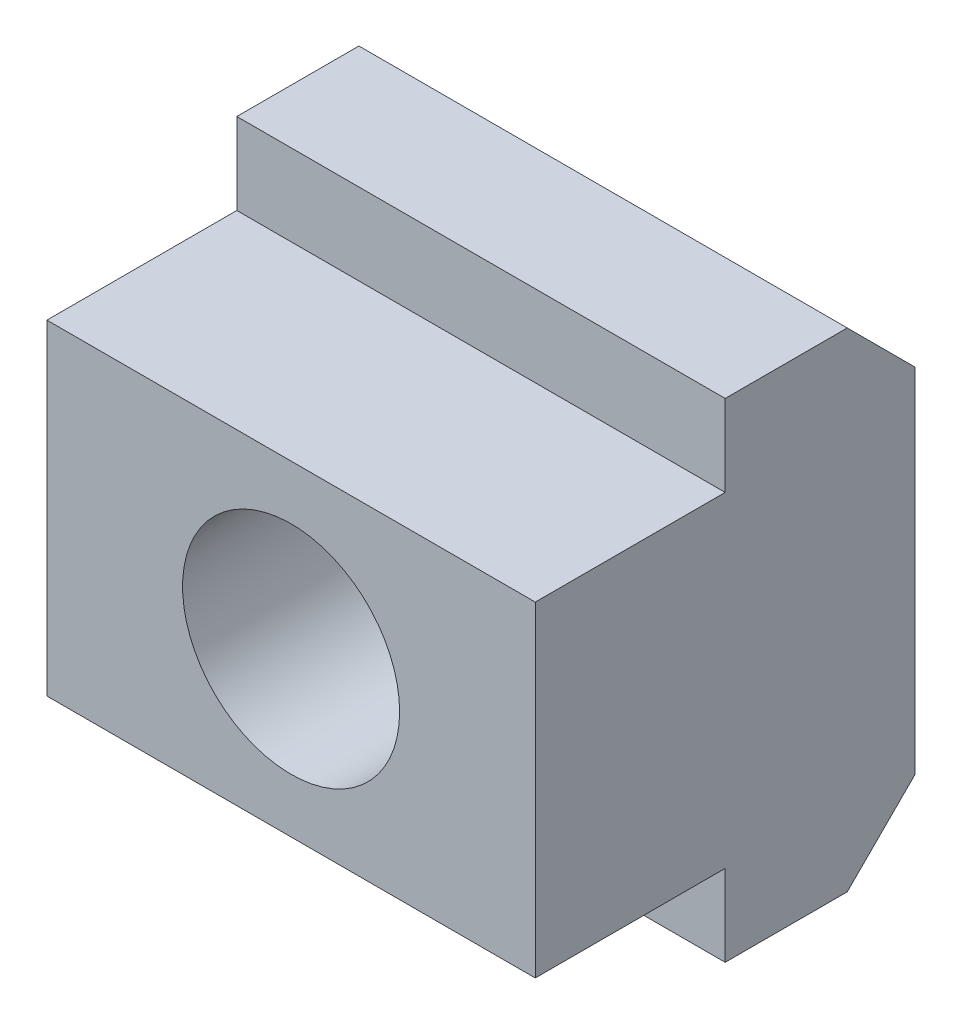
ISO-10303-21;
HEADER;
FILE_DESCRIPTION(('STEP AP214'),'2;1');
FILE_NAME('part.step','',(''),(''),'','','');
FILE_SCHEMA(('AUTOMOTIVE_DESIGN { 1 0 10303 214 1 1 1 1 }'));
ENDSEC;
DATA;
#1=APPLICATION_CONTEXT('core data for automotive mechanical design processes');
#2=APPLICATION_PROTOCOL_DEFINITION('international standard','automotive_design',2000,#1);
#3=PRODUCT_CONTEXT('',#1,'mechanical');
#4=PRODUCT('Part','Part','',(#3));
#5=PRODUCT_RELATED_PRODUCT_CATEGORY('part','',(#4));
#6=PRODUCT_DEFINITION_FORMATION('','',#4);
#7=PRODUCT_DEFINITION_CONTEXT('part definition',#1,'design');
#8=PRODUCT_DEFINITION('design','',#6,#7);
#9=PRODUCT_DEFINITION_SHAPE('','',#8);
#10=(LENGTH_UNIT() NAMED_UNIT(*) SI_UNIT(.MILLI.,.METRE.));
#11=(NAMED_UNIT(*) PLANE_ANGLE_UNIT() SI_UNIT($,.RADIAN.));
#12=(NAMED_UNIT(*) SI_UNIT($,.STERADIAN.) SOLID_ANGLE_UNIT());
#13=UNCERTAINTY_MEASURE_WITH_UNIT(LENGTH_MEASURE(1.E-05),#10,'distance_accuracy_value','');
#14=(GEOMETRIC_REPRESENTATION_CONTEXT(3) GLOBAL_UNCERTAINTY_ASSIGNED_CONTEXT((#13)) GLOBAL_UNIT_ASSIGNED_CONTEXT((#10,
#11,#12)) REPRESENTATION_CONTEXT('',''));
#15=CARTESIAN_POINT('',(0.,0.,0.));
#16=DIRECTION('',(0.,0.,1.));
#17=DIRECTION('',(1.,0.,0.));
#18=AXIS2_PLACEMENT_3D('',#15,#16,#17);
#19=CARTESIAN_POINT('',(9.,6.,7.));
#20=DIRECTION('',(0.,0.,-1.));
#21=DIRECTION('',(0.,1.,0.));
#22=AXIS2_PLACEMENT_3D('',#19,#20,#21);
#23=PLANE('',#22);
#24=CARTESIAN_POINT('',(0.,0.,7.));
#25=DIRECTION('',(0.,0.,1.));
#26=DIRECTION('',(1.,0.,0.));
#27=AXIS2_PLACEMENT_3D('',#24,#25,#26);
#28=CIRCLE('',#27,4.);
#29=CARTESIAN_POINT('',(4.,0.,7.));
#30=VERTEX_POINT('',#29);
#31=EDGE_CURVE('E172',#30,#30,#28,.T.);
#32=ORIENTED_EDGE('',*,*,#31,.F.);
#33=EDGE_LOOP('',(#32));
#34=FACE_BOUND('',#33,.T.);
#35=DIRECTION('',(-1.,0.,0.));
#36=VECTOR('',#35,1.);
#37=CARTESIAN_POINT('',(9.,-6.,7.));
#38=LINE('',#37,#36);
#39=CARTESIAN_POINT('',(9.,-6.,7.));
#40=VERTEX_POINT('',#39);
#41=CARTESIAN_POINT('',(-9.,-6.,7.));
#42=VERTEX_POINT('',#41);
#43=EDGE_CURVE('E151',#40,#42,#38,.T.);
#44=ORIENTED_EDGE('',*,*,#43,.F.);
#45=DIRECTION('',(0.,-1.,0.));
#46=VECTOR('',#45,1.);
#47=CARTESIAN_POINT('',(9.,6.,7.));
#48=LINE('',#47,#46);
#49=CARTESIAN_POINT('',(9.,6.,7.));
#50=VERTEX_POINT('',#49);
#51=EDGE_CURVE('E130',#50,#40,#48,.T.);
#52=ORIENTED_EDGE('',*,*,#51,.F.);
#53=DIRECTION('',(-1.,0.,0.));
#54=VECTOR('',#53,1.);
#55=CARTESIAN_POINT('',(9.,6.,7.));
#56=LINE('',#55,#54);
#57=CARTESIAN_POINT('',(-9.,6.,7.));
#58=VERTEX_POINT('',#57);
#59=EDGE_CURVE('E153',#50,#58,#56,.T.);
#60=ORIENTED_EDGE('',*,*,#59,.T.);
#61=DIRECTION('',(0.,-1.,0.));
#62=VECTOR('',#61,1.);
#63=CARTESIAN_POINT('',(-9.,6.,7.));
#64=LINE('',#63,#62);
#65=EDGE_CURVE('E182',#58,#42,#64,.T.);
#66=ORIENTED_EDGE('',*,*,#65,.T.);
#67=EDGE_LOOP('',(#44,#52,#60,#66));
#68=FACE_BOUND('',#67,.T.);
#69=ADVANCED_FACE('F14',(#34,#68),#23,.F.);
#70=CARTESIAN_POINT('',(9.,6.5,-7.));
#71=DIRECTION('',(0.,-0.707106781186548,0.707106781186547));
#72=DIRECTION('',(0.,-0.707106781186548,-0.707106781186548));
#73=AXIS2_PLACEMENT_3D('',#70,#71,#72);
#74=PLANE('',#73);
#75=DIRECTION('',(-1.,0.,0.));
#76=VECTOR('',#75,1.);
#77=CARTESIAN_POINT('',(9.,9.,-4.5));
#78=LINE('',#77,#76);
#79=CARTESIAN_POINT('',(9.,9.,-4.5));
#80=VERTEX_POINT('',#79);
#81=CARTESIAN_POINT('',(-9.,9.,-4.5));
#82=VERTEX_POINT('',#81);
#83=EDGE_CURVE('E9',#80,#82,#78,.T.);
#84=ORIENTED_EDGE('',*,*,#83,.F.);
#85=DIRECTION('',(0.,0.707106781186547,0.707106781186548));
#86=VECTOR('',#85,1.);
#87=CARTESIAN_POINT('',(9.,6.5,-7.));
#88=LINE('',#87,#86);
#89=CARTESIAN_POINT('',(9.,6.5,-7.));
#90=VERTEX_POINT('',#89);
#91=EDGE_CURVE('E140',#90,#80,#88,.T.);
#92=ORIENTED_EDGE('',*,*,#91,.F.);
#93=DIRECTION('',(-1.,0.,0.));
#94=VECTOR('',#93,1.);
#95=CARTESIAN_POINT('',(9.,6.5,-7.));
#96=LINE('',#95,#94);
#97=CARTESIAN_POINT('',(-9.,6.5,-7.));
#98=VERTEX_POINT('',#97);
#99=EDGE_CURVE('E29',#90,#98,#96,.T.);
#100=ORIENTED_EDGE('',*,*,#99,.T.);
#101=DIRECTION('',(0.,0.707106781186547,0.707106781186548));
#102=VECTOR('',#101,1.);
#103=CARTESIAN_POINT('',(-9.,6.5,-7.));
#104=LINE('',#103,#102);
#105=EDGE_CURVE('E101',#98,#82,#104,.T.);
#106=ORIENTED_EDGE('',*,*,#105,.T.);
#107=EDGE_LOOP('',(#84,#92,#100,#106));
#108=FACE_BOUND('',#107,.T.);
#109=ADVANCED_FACE('F102',(#108),#74,.F.);
#110=CARTESIAN_POINT('',(9.,9.,-4.5));
#111=DIRECTION('',(0.,-1.,0.));
#112=DIRECTION('',(0.,0.,-1.));
#113=AXIS2_PLACEMENT_3D('',#110,#111,#112);
#114=PLANE('',#113);
#115=DIRECTION('',(-1.,0.,0.));
#116=VECTOR('',#115,1.);
#117=CARTESIAN_POINT('',(9.,9.,0.));
#118=LINE('',#117,#116);
#119=CARTESIAN_POINT('',(9.,9.,0.));
#120=VERTEX_POINT('',#119);
#121=CARTESIAN_POINT('',(-9.,9.,0.));
#122=VERTEX_POINT('',#121);
#123=EDGE_CURVE('E22',#120,#122,#118,.T.);
#124=ORIENTED_EDGE('',*,*,#123,.F.);
#125=DIRECTION('',(0.,0.,1.));
#126=VECTOR('',#125,1.);
#127=CARTESIAN_POINT('',(9.,9.,-4.5));
#128=LINE('',#127,#126);
#129=EDGE_CURVE('E97',#80,#120,#128,.T.);
#130=ORIENTED_EDGE('',*,*,#129,.F.);
#131=ORIENTED_EDGE('',*,*,#83,.T.);
#132=DIRECTION('',(0.,0.,1.));
#133=VECTOR('',#132,1.);
#134=CARTESIAN_POINT('',(-9.,9.,-4.5));
#135=LINE('',#134,#133);
#136=EDGE_CURVE('E94',#82,#122,#135,.T.);
#137=ORIENTED_EDGE('',*,*,#136,.T.);
#138=EDGE_LOOP('',(#124,#130,#131,#137));
#139=FACE_BOUND('',#138,.T.);
#140=ADVANCED_FACE('F16',(#139),#114,.F.);
#141=CARTESIAN_POINT('',(9.,9.,0.));
#142=DIRECTION('',(0.,0.,-1.));
#143=DIRECTION('',(-1.,0.,0.));
#144=AXIS2_PLACEMENT_3D('',#141,#142,#143);
#145=PLANE('',#144);
#146=DIRECTION('',(-1.,0.,0.));
#147=VECTOR('',#146,1.);
#148=CARTESIAN_POINT('',(9.,6.,0.));
#149=LINE('',#148,#147);
#150=CARTESIAN_POINT('',(9.,6.,0.));
#151=VERTEX_POINT('',#150);
#152=CARTESIAN_POINT('',(-9.,6.,0.));
#153=VERTEX_POINT('',#152);
#154=EDGE_CURVE('E155',#151,#153,#149,.T.);
#155=ORIENTED_EDGE('',*,*,#154,.F.);
#156=DIRECTION('',(0.,-1.,0.));
#157=VECTOR('',#156,1.);
#158=CARTESIAN_POINT('',(9.,9.,0.));
#159=LINE('',#158,#157);
#160=EDGE_CURVE('E136',#120,#151,#159,.T.);
#161=ORIENTED_EDGE('',*,*,#160,.F.);
#162=ORIENTED_EDGE('',*,*,#123,.T.);
#163=DIRECTION('',(0.,-1.,0.));
#164=VECTOR('',#163,1.);
#165=CARTESIAN_POINT('',(-9.,9.,0.));
#166=LINE('',#165,#164);
#167=EDGE_CURVE('E110',#122,#153,#166,.T.);
#168=ORIENTED_EDGE('',*,*,#167,.T.);
#169=EDGE_LOOP('',(#155,#161,#162,#168));
#170=FACE_BOUND('',#169,.T.);
#171=ADVANCED_FACE('F158',(#170),#145,.F.);
#172=CARTESIAN_POINT('',(9.,6.,0.));
#173=DIRECTION('',(0.,-1.,0.));
#174=DIRECTION('',(0.,0.,-1.));
#175=AXIS2_PLACEMENT_3D('',#172,#173,#174);
#176=PLANE('',#175);
#177=ORIENTED_EDGE('',*,*,#59,.F.);
#178=DIRECTION('',(0.,0.,1.));
#179=VECTOR('',#178,1.);
#180=CARTESIAN_POINT('',(9.,6.,0.));
#181=LINE('',#180,#179);
#182=EDGE_CURVE('E133',#151,#50,#181,.T.);
#183=ORIENTED_EDGE('',*,*,#182,.F.);
#184=ORIENTED_EDGE('',*,*,#154,.T.);
#185=DIRECTION('',(0.,0.,1.));
#186=VECTOR('',#185,1.);
#187=CARTESIAN_POINT('',(-9.,6.,0.));
#188=LINE('',#187,#186);
#189=EDGE_CURVE('E112',#153,#58,#188,.T.);
#190=ORIENTED_EDGE('',*,*,#189,.T.);
#191=EDGE_LOOP('',(#177,#183,#184,#190));
#192=FACE_BOUND('',#191,.T.);
#193=ADVANCED_FACE('F187',(#192),#176,.F.);
#194=CARTESIAN_POINT('',(9.,-6.,7.));
#195=DIRECTION('',(0.,1.,0.));
#196=DIRECTION('',(0.,0.,1.));
#197=AXIS2_PLACEMENT_3D('',#194,#195,#196);
#198=PLANE('',#197);
#199=DIRECTION('',(-1.,0.,0.));
#200=VECTOR('',#199,1.);
#201=CARTESIAN_POINT('',(9.,-6.,0.));
#202=LINE('',#201,#200);
#203=CARTESIAN_POINT('',(9.,-6.,0.));
#204=VERTEX_POINT('',#203);
#205=CARTESIAN_POINT('',(-9.,-6.,0.));
#206=VERTEX_POINT('',#205);
#207=EDGE_CURVE('E149',#204,#206,#202,.T.);
#208=ORIENTED_EDGE('',*,*,#207,.F.);
#209=DIRECTION('',(0.,0.,-1.));
#210=VECTOR('',#209,1.);
#211=CARTESIAN_POINT('',(9.,-6.,7.));
#212=LINE('',#211,#210);
#213=EDGE_CURVE('E127',#40,#204,#212,.T.);
#214=ORIENTED_EDGE('',*,*,#213,.F.);
#215=ORIENTED_EDGE('',*,*,#43,.T.);
#216=DIRECTION('',(0.,0.,-1.));
#217=VECTOR('',#216,1.);
#218=CARTESIAN_POINT('',(-9.,-6.,7.));
#219=LINE('',#218,#217);
#220=EDGE_CURVE('E179',#42,#206,#219,.T.);
#221=ORIENTED_EDGE('',*,*,#220,.T.);
#222=EDGE_LOOP('',(#208,#214,#215,#221));
#223=FACE_BOUND('',#222,.T.);
#224=ADVANCED_FACE('F195',(#223),#198,.F.);
#225=CARTESIAN_POINT('',(9.,-6.,0.));
#226=DIRECTION('',(0.,0.,-1.));
#227=DIRECTION('',(-1.,0.,0.));
#228=AXIS2_PLACEMENT_3D('',#225,#226,#227);
#229=PLANE('',#228);
#230=DIRECTION('',(-1.,0.,0.));
#231=VECTOR('',#230,1.);
#232=CARTESIAN_POINT('',(9.,-9.,0.));
#233=LINE('',#232,#231);
#234=CARTESIAN_POINT('',(9.,-9.,0.));
#235=VERTEX_POINT('',#234);
#236=CARTESIAN_POINT('',(-9.,-9.,0.));
#237=VERTEX_POINT('',#236);
#238=EDGE_CURVE('E147',#235,#237,#233,.T.);
#239=ORIENTED_EDGE('',*,*,#238,.F.);
#240=DIRECTION('',(0.,-1.,0.));
#241=VECTOR('',#240,1.);
#242=CARTESIAN_POINT('',(9.,-6.,0.));
#243=LINE('',#242,#241);
#244=EDGE_CURVE('E124',#204,#235,#243,.T.);
#245=ORIENTED_EDGE('',*,*,#244,.F.);
#246=ORIENTED_EDGE('',*,*,#207,.T.);
#247=DIRECTION('',(0.,-1.,0.));
#248=VECTOR('',#247,1.);
#249=CARTESIAN_POINT('',(-9.,-6.,0.));
#250=LINE('',#249,#248);
#251=EDGE_CURVE('E176',#206,#237,#250,.T.);
#252=ORIENTED_EDGE('',*,*,#251,.T.);
#253=EDGE_LOOP('',(#239,#245,#246,#252));
#254=FACE_BOUND('',#253,.T.);
#255=ADVANCED_FACE('F197',(#254),#229,.F.);
#256=CARTESIAN_POINT('',(9.,-9.,0.));
#257=DIRECTION('',(0.,1.,0.));
#258=DIRECTION('',(0.,0.,1.));
#259=AXIS2_PLACEMENT_3D('',#256,#257,#258);
#260=PLANE('',#259);
#261=DIRECTION('',(-1.,0.,0.));
#262=VECTOR('',#261,1.);
#263=CARTESIAN_POINT('',(9.,-9.,-4.5));
#264=LINE('',#263,#262);
#265=CARTESIAN_POINT('',(9.,-9.,-4.5));
#266=VERTEX_POINT('',#265);
#267=CARTESIAN_POINT('',(-9.,-9.,-4.5));
#268=VERTEX_POINT('',#267);
#269=EDGE_CURVE('E145',#266,#268,#264,.T.);
#270=ORIENTED_EDGE('',*,*,#269,.F.);
#271=DIRECTION('',(0.,0.,-1.));
#272=VECTOR('',#271,1.);
#273=CARTESIAN_POINT('',(9.,-9.,0.));
#274=LINE('',#273,#272);
#275=EDGE_CURVE('E121',#235,#266,#274,.T.);
#276=ORIENTED_EDGE('',*,*,#275,.F.);
#277=ORIENTED_EDGE('',*,*,#238,.T.);
#278=DIRECTION('',(0.,0.,-1.));
#279=VECTOR('',#278,1.);
#280=CARTESIAN_POINT('',(-9.,-9.,0.));
#281=LINE('',#280,#279);
#282=EDGE_CURVE('E168',#237,#268,#281,.T.);
#283=ORIENTED_EDGE('',*,*,#282,.T.);
#284=EDGE_LOOP('',(#270,#276,#277,#283));
#285=FACE_BOUND('',#284,.T.);
#286=ADVANCED_FACE('F200',(#285),#260,.F.);
#287=CARTESIAN_POINT('',(9.,-9.,-4.5));
#288=DIRECTION('',(0.,0.707106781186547,0.707106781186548));
#289=DIRECTION('',(0.,-0.707106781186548,0.707106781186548));
#290=AXIS2_PLACEMENT_3D('',#287,#288,#289);
#291=PLANE('',#290);
#292=DIRECTION('',(-1.,0.,0.));
#293=VECTOR('',#292,1.);
#294=CARTESIAN_POINT('',(9.,-6.5,-7.));
#295=LINE('',#294,#293);
#296=CARTESIAN_POINT('',(9.,-6.5,-7.));
#297=VERTEX_POINT('',#296);
#298=CARTESIAN_POINT('',(-9.,-6.5,-7.));
#299=VERTEX_POINT('',#298);
#300=EDGE_CURVE('E37',#297,#299,#295,.T.);
#301=ORIENTED_EDGE('',*,*,#300,.F.);
#302=DIRECTION('',(0.,0.707106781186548,-0.707106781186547));
#303=VECTOR('',#302,1.);
#304=CARTESIAN_POINT('',(9.,-9.,-4.5));
#305=LINE('',#304,#303);
#306=EDGE_CURVE('E119',#266,#297,#305,.T.);
#307=ORIENTED_EDGE('',*,*,#306,.F.);
#308=ORIENTED_EDGE('',*,*,#269,.T.);
#309=DIRECTION('',(0.,0.707106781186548,-0.707106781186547));
#310=VECTOR('',#309,1.);
#311=CARTESIAN_POINT('',(-9.,-9.,-4.5));
#312=LINE('',#311,#310);
#313=EDGE_CURVE('E164',#268,#299,#312,.T.);
#314=ORIENTED_EDGE('',*,*,#313,.T.);
#315=EDGE_LOOP('',(#301,#307,#308,#314));
#316=FACE_BOUND('',#315,.T.);
#317=ADVANCED_FACE('F165',(#316),#291,.F.);
#318=CARTESIAN_POINT('',(9.,-6.5,-7.));
#319=DIRECTION('',(0.,0.,1.));
#320=DIRECTION('',(1.,0.,0.));
#321=AXIS2_PLACEMENT_3D('',#318,#319,#320);
#322=PLANE('',#321);
#323=CARTESIAN_POINT('',(0.,0.,-7.));
#324=DIRECTION('',(0.,0.,1.));
#325=DIRECTION('',(1.,0.,0.));
#326=AXIS2_PLACEMENT_3D('',#323,#324,#325);
#327=CIRCLE('',#326,4.);
#328=CARTESIAN_POINT('',(4.,0.,-7.));
#329=VERTEX_POINT('',#328);
#330=EDGE_CURVE('E105',#329,#329,#327,.T.);
#331=ORIENTED_EDGE('',*,*,#330,.T.);
#332=EDGE_LOOP('',(#331));
#333=FACE_BOUND('',#332,.T.);
#334=DIRECTION('',(0.,1.,0.));
#335=VECTOR('',#334,1.);
#336=CARTESIAN_POINT('',(9.,-6.5,-7.));
#337=LINE('',#336,#335);
#338=EDGE_CURVE('E116',#297,#90,#337,.T.);
#339=ORIENTED_EDGE('',*,*,#338,.F.);
#340=ORIENTED_EDGE('',*,*,#300,.T.);
#341=DIRECTION('',(0.,1.,0.));
#342=VECTOR('',#341,1.);
#343=CARTESIAN_POINT('',(-9.,-6.5,-7.));
#344=LINE('',#343,#342);
#345=EDGE_CURVE('E142',#299,#98,#344,.T.);
#346=ORIENTED_EDGE('',*,*,#345,.T.);
#347=ORIENTED_EDGE('',*,*,#99,.F.);
#348=EDGE_LOOP('',(#339,#340,#346,#347));
#349=FACE_BOUND('',#348,.T.);
#350=ADVANCED_FACE('F162',(#333,#349),#322,.F.);
#351=CARTESIAN_POINT('',(9.,0.,-13.5));
#352=DIRECTION('',(-1.,0.,0.));
#353=DIRECTION('',(0.,0.,1.));
#354=AXIS2_PLACEMENT_3D('',#351,#352,#353);
#355=PLANE('',#354);
#356=ORIENTED_EDGE('',*,*,#91,.T.);
#357=ORIENTED_EDGE('',*,*,#129,.T.);
#358=ORIENTED_EDGE('',*,*,#160,.T.);
#359=ORIENTED_EDGE('',*,*,#182,.T.);
#360=ORIENTED_EDGE('',*,*,#51,.T.);
#361=ORIENTED_EDGE('',*,*,#213,.T.);
#362=ORIENTED_EDGE('',*,*,#244,.T.);
#363=ORIENTED_EDGE('',*,*,#275,.T.);
#364=ORIENTED_EDGE('',*,*,#306,.T.);
#365=ORIENTED_EDGE('',*,*,#338,.T.);
#366=EDGE_LOOP('',(#356,#357,#358,#359,#360,#361,#362,#363,#364,#365));
#367=FACE_BOUND('',#366,.T.);
#368=ADVANCED_FACE('F160',(#367),#355,.F.);
#369=CARTESIAN_POINT('',(-9.,0.,-13.5));
#370=DIRECTION('',(-1.,0.,0.));
#371=DIRECTION('',(0.,0.,1.));
#372=AXIS2_PLACEMENT_3D('',#369,#370,#371);
#373=PLANE('',#372);
#374=ORIENTED_EDGE('',*,*,#105,.F.);
#375=ORIENTED_EDGE('',*,*,#345,.F.);
#376=ORIENTED_EDGE('',*,*,#313,.F.);
#377=ORIENTED_EDGE('',*,*,#282,.F.);
#378=ORIENTED_EDGE('',*,*,#251,.F.);
#379=ORIENTED_EDGE('',*,*,#220,.F.);
#380=ORIENTED_EDGE('',*,*,#65,.F.);
#381=ORIENTED_EDGE('',*,*,#189,.F.);
#382=ORIENTED_EDGE('',*,*,#167,.F.);
#383=ORIENTED_EDGE('',*,*,#136,.F.);
#384=EDGE_LOOP('',(#374,#375,#376,#377,#378,#379,#380,#381,#382,#383));
#385=FACE_BOUND('',#384,.T.);
#386=ADVANCED_FACE('F107',(#385),#373,.T.);
#387=CARTESIAN_POINT('',(0.,0.,-7.));
#388=DIRECTION('',(0.,0.,1.));
#389=DIRECTION('',(1.,0.,0.));
#390=AXIS2_PLACEMENT_3D('',#387,#388,#389);
#391=CYLINDRICAL_SURFACE('',#390,4.);
#392=ORIENTED_EDGE('',*,*,#330,.F.);
#393=EDGE_LOOP('',(#392));
#394=FACE_BOUND('',#393,.T.);
#395=ORIENTED_EDGE('',*,*,#31,.T.);
#396=EDGE_LOOP('',(#395));
#397=FACE_BOUND('',#396,.T.);
#398=ADVANCED_FACE('F287',(#394,#397),#391,.F.);
#399=CLOSED_SHELL('',(#69,#109,#140,#171,#193,#224,#255,#286,#317,#350,#368,#386,#398));
#400=MANIFOLD_SOLID_BREP('B1',#399);
#401=ADVANCED_BREP_SHAPE_REPRESENTATION('',(#18,#400),#14);
#402=SHAPE_DEFINITION_REPRESENTATION(#9,#401);
ENDSEC;
END-ISO-10303-21;
